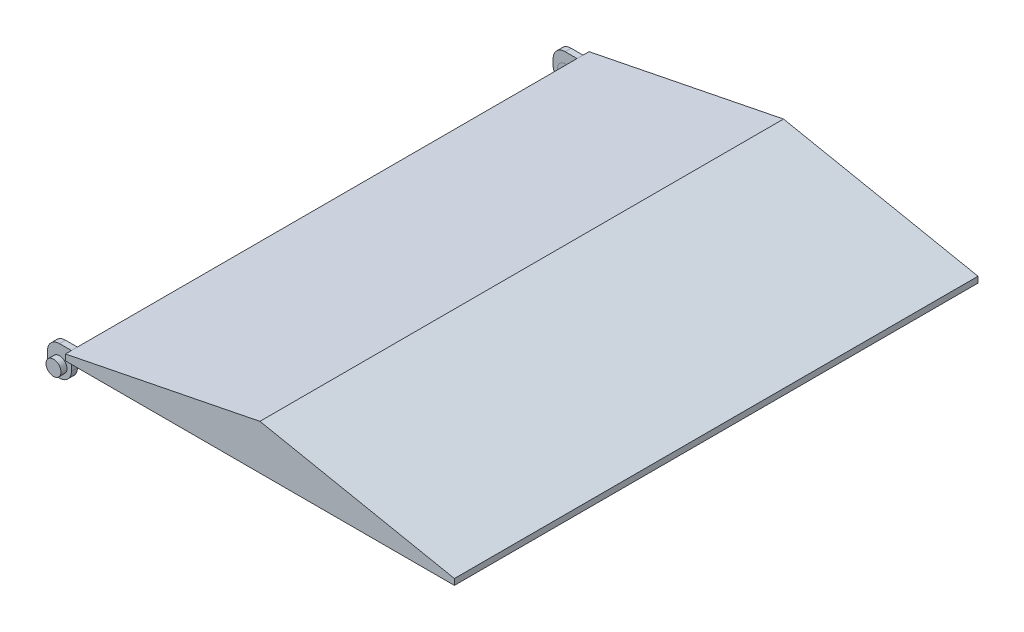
ISO-10303-21;
HEADER;
FILE_DESCRIPTION(('STEP AP214'),'2;1');
FILE_NAME('part.step','',(''),(''),'','','');
FILE_SCHEMA(('AUTOMOTIVE_DESIGN { 1 0 10303 214 1 1 1 1 }'));
ENDSEC;
DATA;
#1=APPLICATION_CONTEXT('core data for automotive mechanical design processes');
#2=APPLICATION_PROTOCOL_DEFINITION('international standard','automotive_design',2000,#1);
#3=PRODUCT_CONTEXT('',#1,'mechanical');
#4=PRODUCT('Part','Part','',(#3));
#5=PRODUCT_RELATED_PRODUCT_CATEGORY('part','',(#4));
#6=PRODUCT_DEFINITION_FORMATION('','',#4);
#7=PRODUCT_DEFINITION_CONTEXT('part definition',#1,'design');
#8=PRODUCT_DEFINITION('design','',#6,#7);
#9=PRODUCT_DEFINITION_SHAPE('','',#8);
#10=(LENGTH_UNIT() NAMED_UNIT(*) SI_UNIT(.MILLI.,.METRE.));
#11=(NAMED_UNIT(*) PLANE_ANGLE_UNIT() SI_UNIT($,.RADIAN.));
#12=(NAMED_UNIT(*) SI_UNIT($,.STERADIAN.) SOLID_ANGLE_UNIT());
#13=UNCERTAINTY_MEASURE_WITH_UNIT(LENGTH_MEASURE(1.E-05),#10,'distance_accuracy_value','');
#14=(GEOMETRIC_REPRESENTATION_CONTEXT(3) GLOBAL_UNCERTAINTY_ASSIGNED_CONTEXT((#13)) GLOBAL_UNIT_ASSIGNED_CONTEXT((#10,
#11,#12)) REPRESENTATION_CONTEXT('',''));
#15=CARTESIAN_POINT('',(0.,0.,0.));
#16=DIRECTION('',(0.,0.,1.));
#17=DIRECTION('',(1.,0.,0.));
#18=AXIS2_PLACEMENT_3D('',#15,#16,#17);
#19=CARTESIAN_POINT('',(-690.,-40.0000000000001,1750.));
#20=DIRECTION('',(0.,0.,-1.));
#21=DIRECTION('',(-1.,0.,0.));
#22=AXIS2_PLACEMENT_3D('',#19,#20,#21);
#23=CYLINDRICAL_SURFACE('',#22,25.);
#24=CARTESIAN_POINT('',(-690.,-40.0000000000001,1750.));
#25=DIRECTION('',(0.,0.,1.));
#26=DIRECTION('',(1.,0.,0.));
#27=AXIS2_PLACEMENT_3D('',#24,#25,#26);
#28=CIRCLE('',#27,25.);
#29=CARTESIAN_POINT('',(-665.,-40.0000000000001,1750.));
#30=VERTEX_POINT('',#29);
#31=EDGE_CURVE('E11',#30,#30,#28,.T.);
#32=ORIENTED_EDGE('',*,*,#31,.F.);
#33=EDGE_LOOP('',(#32));
#34=FACE_BOUND('',#33,.T.);
#35=CARTESIAN_POINT('',(-690.,-40.0000000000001,1710.));
#36=DIRECTION('',(0.,0.,1.));
#37=DIRECTION('',(1.,0.,0.));
#38=AXIS2_PLACEMENT_3D('',#35,#36,#37);
#39=CIRCLE('',#38,25.);
#40=CARTESIAN_POINT('',(-665.,-40.0000000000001,1710.));
#41=VERTEX_POINT('',#40);
#42=EDGE_CURVE('E53',#41,#41,#39,.T.);
#43=ORIENTED_EDGE('',*,*,#42,.T.);
#44=EDGE_LOOP('',(#43));
#45=FACE_BOUND('',#44,.T.);
#46=ADVANCED_FACE('F50',(#34,#45),#23,.T.);
#47=CARTESIAN_POINT('',(0.,0.,1750.));
#48=DIRECTION('',(0.,0.,1.));
#49=DIRECTION('',(1.,0.,0.));
#50=AXIS2_PLACEMENT_3D('',#47,#48,#49);
#51=PLANE('',#50);
#52=ORIENTED_EDGE('',*,*,#31,.T.);
#53=EDGE_LOOP('',(#52));
#54=FACE_BOUND('',#53,.T.);
#55=ADVANCED_FACE('F65',(#54),#51,.T.);
#56=CARTESIAN_POINT('',(0.,0.,1710.));
#57=DIRECTION('',(0.,0.,1.));
#58=DIRECTION('',(1.,0.,0.));
#59=AXIS2_PLACEMENT_3D('',#56,#57,#58);
#60=PLANE('',#59);
#61=ORIENTED_EDGE('',*,*,#42,.F.);
#62=EDGE_LOOP('',(#61));
#63=FACE_BOUND('',#62,.T.);
#64=ADVANCED_FACE('F63',(#63),#60,.F.);
#65=CLOSED_SHELL('',(#46,#55,#64));
#66=MANIFOLD_SOLID_BREP('B2',#65);
#67=CARTESIAN_POINT('',(-690.,-40.0000000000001,40.));
#68=DIRECTION('',(0.,0.,-1.));
#69=DIRECTION('',(-1.,0.,0.));
#70=AXIS2_PLACEMENT_3D('',#67,#68,#69);
#71=CYLINDRICAL_SURFACE('',#70,25.);
#72=CARTESIAN_POINT('',(-690.,-40.0000000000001,40.));
#73=DIRECTION('',(0.,0.,1.));
#74=DIRECTION('',(1.,0.,0.));
#75=AXIS2_PLACEMENT_3D('',#72,#73,#74);
#76=CIRCLE('',#75,25.);
#77=CARTESIAN_POINT('',(-665.,-40.0000000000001,40.));
#78=VERTEX_POINT('',#77);
#79=EDGE_CURVE('E49',#78,#78,#76,.T.);
#80=ORIENTED_EDGE('',*,*,#79,.F.);
#81=EDGE_LOOP('',(#80));
#82=FACE_BOUND('',#81,.T.);
#83=CARTESIAN_POINT('',(-690.,-40.0000000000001,0.));
#84=DIRECTION('',(0.,0.,1.));
#85=DIRECTION('',(1.,0.,0.));
#86=AXIS2_PLACEMENT_3D('',#83,#84,#85);
#87=CIRCLE('',#86,25.);
#88=CARTESIAN_POINT('',(-665.,-40.0000000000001,0.));
#89=VERTEX_POINT('',#88);
#90=EDGE_CURVE('E109',#89,#89,#87,.T.);
#91=ORIENTED_EDGE('',*,*,#90,.T.);
#92=EDGE_LOOP('',(#91));
#93=FACE_BOUND('',#92,.T.);
#94=ADVANCED_FACE('F106',(#82,#93),#71,.T.);
#95=CARTESIAN_POINT('',(0.,0.,40.));
#96=DIRECTION('',(0.,0.,1.));
#97=DIRECTION('',(1.,0.,0.));
#98=AXIS2_PLACEMENT_3D('',#95,#96,#97);
#99=PLANE('',#98);
#100=ORIENTED_EDGE('',*,*,#79,.T.);
#101=EDGE_LOOP('',(#100));
#102=FACE_BOUND('',#101,.T.);
#103=ADVANCED_FACE('F121',(#102),#99,.T.);
#104=CARTESIAN_POINT('',(0.,0.,0.));
#105=DIRECTION('',(0.,0.,1.));
#106=DIRECTION('',(1.,0.,0.));
#107=AXIS2_PLACEMENT_3D('',#104,#105,#106);
#108=PLANE('',#107);
#109=ORIENTED_EDGE('',*,*,#90,.F.);
#110=EDGE_LOOP('',(#109));
#111=FACE_BOUND('',#110,.T.);
#112=ADVANCED_FACE('F119',(#111),#108,.F.);
#113=CLOSED_SHELL('',(#94,#103,#112));
#114=MANIFOLD_SOLID_BREP('B6',#113);
#115=CARTESIAN_POINT('',(-650.,0.,1750.));
#116=DIRECTION('',(1.,0.,0.));
#117=DIRECTION('',(0.,0.,-1.));
#118=AXIS2_PLACEMENT_3D('',#115,#116,#117);
#119=PLANE('',#118);
#120=DIRECTION('',(0.,-1.,0.));
#121=VECTOR('',#120,1.);
#122=CARTESIAN_POINT('',(-650.,0.,1710.));
#123=LINE('',#122,#121);
#124=CARTESIAN_POINT('',(-650.,19.9999999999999,1710.));
#125=VERTEX_POINT('',#124);
#126=CARTESIAN_POINT('',(-650.,0.,1710.));
#127=VERTEX_POINT('',#126);
#128=EDGE_CURVE('E453',#125,#127,#123,.T.);
#129=ORIENTED_EDGE('',*,*,#128,.F.);
#130=DIRECTION('',(0.,0.,-1.));
#131=VECTOR('',#130,1.);
#132=CARTESIAN_POINT('',(-650.,19.9999999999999,1750.));
#133=LINE('',#132,#131);
#134=CARTESIAN_POINT('',(-650.,19.9999999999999,40.));
#135=VERTEX_POINT('',#134);
#136=EDGE_CURVE('E346',#125,#135,#133,.T.);
#137=ORIENTED_EDGE('',*,*,#136,.T.);
#138=DIRECTION('',(0.,-1.,0.));
#139=VECTOR('',#138,1.);
#140=CARTESIAN_POINT('',(-650.,0.,40.));
#141=LINE('',#140,#139);
#142=CARTESIAN_POINT('',(-650.,0.,40.));
#143=VERTEX_POINT('',#142);
#144=EDGE_CURVE('E462',#135,#143,#141,.T.);
#145=ORIENTED_EDGE('',*,*,#144,.T.);
#146=DIRECTION('',(0.,0.,-1.));
#147=VECTOR('',#146,1.);
#148=CARTESIAN_POINT('',(-650.,0.,1750.));
#149=LINE('',#148,#147);
#150=EDGE_CURVE('E367',#127,#143,#149,.T.);
#151=ORIENTED_EDGE('',*,*,#150,.F.);
#152=EDGE_LOOP('',(#129,#137,#145,#151));
#153=FACE_BOUND('',#152,.T.);
#154=ADVANCED_FACE('F154',(#153),#119,.F.);
#155=DIRECTION('',(0.,-1.,0.));
#156=VECTOR('',#155,1.);
#157=CARTESIAN_POINT('',(-650.,0.,20.));
#158=LINE('',#157,#156);
#159=CARTESIAN_POINT('',(-650.,19.9999999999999,20.));
#160=VERTEX_POINT('',#159);
#161=CARTESIAN_POINT('',(-650.,0.,20.));
#162=VERTEX_POINT('',#161);
#163=EDGE_CURVE('E474',#160,#162,#158,.T.);
#164=ORIENTED_EDGE('',*,*,#163,.F.);
#165=CARTESIAN_POINT('',(-650.,19.9999999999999,0.));
#166=VERTEX_POINT('',#165);
#167=EDGE_CURVE('E354',#160,#166,#133,.T.);
#168=ORIENTED_EDGE('',*,*,#167,.T.);
#169=DIRECTION('',(0.,-1.,0.));
#170=VECTOR('',#169,1.);
#171=CARTESIAN_POINT('',(-650.,0.,0.));
#172=LINE('',#171,#170);
#173=CARTESIAN_POINT('',(-650.,0.,0.));
#174=VERTEX_POINT('',#173);
#175=EDGE_CURVE('E525',#166,#174,#172,.T.);
#176=ORIENTED_EDGE('',*,*,#175,.T.);
#177=EDGE_CURVE('E372',#162,#174,#149,.T.);
#178=ORIENTED_EDGE('',*,*,#177,.F.);
#179=EDGE_LOOP('',(#164,#168,#176,#178));
#180=FACE_BOUND('',#179,.T.);
#181=ADVANCED_FACE('F542',(#180),#119,.F.);
#182=CARTESIAN_POINT('',(-28.8461538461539,144.230769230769,1750.));
#183=DIRECTION('',(-0.196116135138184,0.98058067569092,0.));
#184=DIRECTION('',(-0.98058067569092,-0.196116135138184,0.));
#185=AXIS2_PLACEMENT_3D('',#182,#183,#184);
#186=PLANE('',#185);
#187=DIRECTION('',(0.98058067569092,0.196116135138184,0.));
#188=VECTOR('',#187,1.);
#189=CARTESIAN_POINT('',(-28.8461538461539,144.230769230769,0.));
#190=LINE('',#189,#188);
#191=CARTESIAN_POINT('',(0.,150.,0.));
#192=VERTEX_POINT('',#191);
#193=EDGE_CURVE('E514',#166,#192,#190,.T.);
#194=ORIENTED_EDGE('',*,*,#193,.F.);
#195=ORIENTED_EDGE('',*,*,#167,.F.);
#196=DIRECTION('',(0.,0.,-1.));
#197=VECTOR('',#196,1.);
#198=CARTESIAN_POINT('',(-650.,19.9999999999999,40.));
#199=LINE('',#198,#197);
#200=EDGE_CURVE('E470',#135,#160,#199,.T.);
#201=ORIENTED_EDGE('',*,*,#200,.F.);
#202=ORIENTED_EDGE('',*,*,#136,.F.);
#203=DIRECTION('',(0.,0.,-1.));
#204=VECTOR('',#203,1.);
#205=CARTESIAN_POINT('',(-650.,19.9999999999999,1730.));
#206=LINE('',#205,#204);
#207=CARTESIAN_POINT('',(-650.,19.9999999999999,1730.));
#208=VERTEX_POINT('',#207);
#209=EDGE_CURVE('E321',#208,#125,#206,.T.);
#210=ORIENTED_EDGE('',*,*,#209,.F.);
#211=CARTESIAN_POINT('',(-650.,19.9999999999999,1750.));
#212=VERTEX_POINT('',#211);
#213=EDGE_CURVE('E342',#212,#208,#133,.T.);
#214=ORIENTED_EDGE('',*,*,#213,.F.);
#215=DIRECTION('',(0.98058067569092,0.196116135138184,0.));
#216=VECTOR('',#215,1.);
#217=CARTESIAN_POINT('',(-28.8461538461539,144.230769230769,1750.));
#218=LINE('',#217,#216);
#219=CARTESIAN_POINT('',(0.,150.,1750.));
#220=VERTEX_POINT('',#219);
#221=EDGE_CURVE('E522',#212,#220,#218,.T.);
#222=ORIENTED_EDGE('',*,*,#221,.T.);
#223=DIRECTION('',(0.,0.,-1.));
#224=VECTOR('',#223,1.);
#225=CARTESIAN_POINT('',(0.,150.,1750.));
#226=LINE('',#225,#224);
#227=EDGE_CURVE('E383',#220,#192,#226,.T.);
#228=ORIENTED_EDGE('',*,*,#227,.T.);
#229=EDGE_LOOP('',(#194,#195,#201,#202,#210,#214,#222,#228));
#230=FACE_BOUND('',#229,.T.);
#231=ADVANCED_FACE('F340',(#230),#186,.T.);
#232=ORIENTED_EDGE('',*,*,#213,.T.);
#233=DIRECTION('',(0.,-1.,0.));
#234=VECTOR('',#233,1.);
#235=CARTESIAN_POINT('',(-650.,0.,1730.));
#236=LINE('',#235,#234);
#237=CARTESIAN_POINT('',(-650.,0.,1730.));
#238=VERTEX_POINT('',#237);
#239=EDGE_CURVE('E325',#208,#238,#236,.T.);
#240=ORIENTED_EDGE('',*,*,#239,.T.);
#241=CARTESIAN_POINT('',(-650.,0.,1750.));
#242=VERTEX_POINT('',#241);
#243=EDGE_CURVE('E360',#242,#238,#149,.T.);
#244=ORIENTED_EDGE('',*,*,#243,.F.);
#245=DIRECTION('',(0.,-1.,0.));
#246=VECTOR('',#245,1.);
#247=CARTESIAN_POINT('',(-650.,0.,1750.));
#248=LINE('',#247,#246);
#249=EDGE_CURVE('E350',#212,#242,#248,.T.);
#250=ORIENTED_EDGE('',*,*,#249,.F.);
#251=EDGE_LOOP('',(#232,#240,#244,#250));
#252=FACE_BOUND('',#251,.T.);
#253=ADVANCED_FACE('F349',(#252),#119,.F.);
#254=CARTESIAN_POINT('',(0.,0.,1750.));
#255=DIRECTION('',(0.,-1.,0.));
#256=DIRECTION('',(1.,0.,0.));
#257=AXIS2_PLACEMENT_3D('',#254,#255,#256);
#258=PLANE('',#257);
#259=DIRECTION('',(-1.,0.,0.));
#260=VECTOR('',#259,1.);
#261=CARTESIAN_POINT('',(0.,0.,0.));
#262=LINE('',#261,#260);
#263=CARTESIAN_POINT('',(650.,0.,0.));
#264=VERTEX_POINT('',#263);
#265=EDGE_CURVE('E540',#264,#174,#262,.T.);
#266=ORIENTED_EDGE('',*,*,#265,.F.);
#267=DIRECTION('',(0.,0.,-1.));
#268=VECTOR('',#267,1.);
#269=CARTESIAN_POINT('',(650.,0.,1750.));
#270=LINE('',#269,#268);
#271=CARTESIAN_POINT('',(650.,0.,1750.));
#272=VERTEX_POINT('',#271);
#273=EDGE_CURVE('E376',#272,#264,#270,.T.);
#274=ORIENTED_EDGE('',*,*,#273,.F.);
#275=DIRECTION('',(-1.,0.,0.));
#276=VECTOR('',#275,1.);
#277=CARTESIAN_POINT('',(0.,0.,1750.));
#278=LINE('',#277,#276);
#279=EDGE_CURVE('E529',#272,#242,#278,.T.);
#280=ORIENTED_EDGE('',*,*,#279,.T.);
#281=ORIENTED_EDGE('',*,*,#243,.T.);
#282=EDGE_CURVE('E366',#238,#127,#149,.T.);
#283=ORIENTED_EDGE('',*,*,#282,.T.);
#284=ORIENTED_EDGE('',*,*,#150,.T.);
#285=EDGE_CURVE('E368',#143,#162,#149,.T.);
#286=ORIENTED_EDGE('',*,*,#285,.T.);
#287=ORIENTED_EDGE('',*,*,#177,.T.);
#288=EDGE_LOOP('',(#266,#274,#280,#281,#283,#284,#286,#287));
#289=FACE_BOUND('',#288,.T.);
#290=ADVANCED_FACE('F546',(#289),#258,.T.);
#291=CARTESIAN_POINT('',(650.,0.,1750.));
#292=DIRECTION('',(1.,0.,0.));
#293=DIRECTION('',(0.,0.,-1.));
#294=AXIS2_PLACEMENT_3D('',#291,#292,#293);
#295=PLANE('',#294);
#296=DIRECTION('',(0.,-1.,0.));
#297=VECTOR('',#296,1.);
#298=CARTESIAN_POINT('',(650.,0.,0.));
#299=LINE('',#298,#297);
#300=CARTESIAN_POINT('',(650.,20.,0.));
#301=VERTEX_POINT('',#300);
#302=EDGE_CURVE('E537',#301,#264,#299,.T.);
#303=ORIENTED_EDGE('',*,*,#302,.F.);
#304=DIRECTION('',(0.,0.,-1.));
#305=VECTOR('',#304,1.);
#306=CARTESIAN_POINT('',(650.,20.,1750.));
#307=LINE('',#306,#305);
#308=CARTESIAN_POINT('',(650.,20.,1750.));
#309=VERTEX_POINT('',#308);
#310=EDGE_CURVE('E379',#309,#301,#307,.T.);
#311=ORIENTED_EDGE('',*,*,#310,.F.);
#312=DIRECTION('',(0.,-1.,0.));
#313=VECTOR('',#312,1.);
#314=CARTESIAN_POINT('',(650.,0.,1750.));
#315=LINE('',#314,#313);
#316=EDGE_CURVE('E527',#309,#272,#315,.T.);
#317=ORIENTED_EDGE('',*,*,#316,.T.);
#318=ORIENTED_EDGE('',*,*,#273,.T.);
#319=EDGE_LOOP('',(#303,#311,#317,#318));
#320=FACE_BOUND('',#319,.T.);
#321=ADVANCED_FACE('F551',(#320),#295,.T.);
#322=CARTESIAN_POINT('',(28.8461538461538,144.230769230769,1750.));
#323=DIRECTION('',(-0.196116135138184,-0.98058067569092,0.));
#324=DIRECTION('',(0.98058067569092,-0.196116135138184,0.));
#325=AXIS2_PLACEMENT_3D('',#322,#323,#324);
#326=PLANE('',#325);
#327=DIRECTION('',(-0.98058067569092,0.196116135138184,0.));
#328=VECTOR('',#327,1.);
#329=CARTESIAN_POINT('',(28.8461538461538,144.230769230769,0.));
#330=LINE('',#329,#328);
#331=EDGE_CURVE('E534',#301,#192,#330,.T.);
#332=ORIENTED_EDGE('',*,*,#331,.T.);
#333=ORIENTED_EDGE('',*,*,#227,.F.);
#334=DIRECTION('',(-0.98058067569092,0.196116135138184,0.));
#335=VECTOR('',#334,1.);
#336=CARTESIAN_POINT('',(28.8461538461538,144.230769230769,1750.));
#337=LINE('',#336,#335);
#338=EDGE_CURVE('E524',#309,#220,#337,.T.);
#339=ORIENTED_EDGE('',*,*,#338,.F.);
#340=ORIENTED_EDGE('',*,*,#310,.T.);
#341=EDGE_LOOP('',(#332,#333,#339,#340));
#342=FACE_BOUND('',#341,.T.);
#343=ADVANCED_FACE('F555',(#342),#326,.F.);
#344=CARTESIAN_POINT('',(0.,0.,1750.));
#345=DIRECTION('',(0.,0.,-1.));
#346=DIRECTION('',(-1.,0.,0.));
#347=AXIS2_PLACEMENT_3D('',#344,#345,#346);
#348=PLANE('',#347);
#349=ORIENTED_EDGE('',*,*,#221,.F.);
#350=ORIENTED_EDGE('',*,*,#249,.T.);
#351=ORIENTED_EDGE('',*,*,#279,.F.);
#352=ORIENTED_EDGE('',*,*,#316,.F.);
#353=ORIENTED_EDGE('',*,*,#338,.T.);
#354=EDGE_LOOP('',(#349,#350,#351,#352,#353));
#355=FACE_BOUND('',#354,.T.);
#356=ADVANCED_FACE('F550',(#355),#348,.F.);
#357=CARTESIAN_POINT('',(0.,0.,0.));
#358=DIRECTION('',(0.,0.,-1.));
#359=DIRECTION('',(-1.,0.,0.));
#360=AXIS2_PLACEMENT_3D('',#357,#358,#359);
#361=PLANE('',#360);
#362=ORIENTED_EDGE('',*,*,#193,.T.);
#363=ORIENTED_EDGE('',*,*,#331,.F.);
#364=ORIENTED_EDGE('',*,*,#302,.T.);
#365=ORIENTED_EDGE('',*,*,#265,.T.);
#366=ORIENTED_EDGE('',*,*,#175,.F.);
#367=EDGE_LOOP('',(#362,#363,#364,#365,#366));
#368=FACE_BOUND('',#367,.T.);
#369=ADVANCED_FACE('F544',(#368),#361,.T.);
#370=CARTESIAN_POINT('',(-650.,0.,40.));
#371=DIRECTION('',(1.,0.,0.));
#372=DIRECTION('',(0.,0.,-1.));
#373=AXIS2_PLACEMENT_3D('',#370,#371,#372);
#374=PLANE('',#373);
#375=CARTESIAN_POINT('',(-650.,-40.0000000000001,40.));
#376=VERTEX_POINT('',#375);
#377=EDGE_CURVE('E460',#143,#376,#141,.T.);
#378=ORIENTED_EDGE('',*,*,#377,.T.);
#379=DIRECTION('',(0.,0.,-1.));
#380=VECTOR('',#379,1.);
#381=CARTESIAN_POINT('',(-650.,-40.0000000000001,40.));
#382=LINE('',#381,#380);
#383=CARTESIAN_POINT('',(-650.,-40.0000000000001,20.));
#384=VERTEX_POINT('',#383);
#385=EDGE_CURVE('E352',#376,#384,#382,.T.);
#386=ORIENTED_EDGE('',*,*,#385,.T.);
#387=EDGE_CURVE('E473',#162,#384,#158,.T.);
#388=ORIENTED_EDGE('',*,*,#387,.F.);
#389=ORIENTED_EDGE('',*,*,#285,.F.);
#390=EDGE_LOOP('',(#378,#386,#388,#389));
#391=FACE_BOUND('',#390,.T.);
#392=ADVANCED_FACE('F585',(#391),#374,.T.);
#393=CARTESIAN_POINT('',(0.,19.9999999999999,40.));
#394=DIRECTION('',(0.,1.,0.));
#395=DIRECTION('',(0.,0.,1.));
#396=AXIS2_PLACEMENT_3D('',#393,#394,#395);
#397=PLANE('',#396);
#398=DIRECTION('',(1.,0.,0.));
#399=VECTOR('',#398,1.);
#400=CARTESIAN_POINT('',(0.,19.9999999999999,20.));
#401=LINE('',#400,#399);
#402=CARTESIAN_POINT('',(-690.,19.9999999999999,20.));
#403=VERTEX_POINT('',#402);
#404=EDGE_CURVE('E477',#403,#160,#401,.T.);
#405=ORIENTED_EDGE('',*,*,#404,.F.);
#406=DIRECTION('',(0.,0.,-1.));
#407=VECTOR('',#406,1.);
#408=CARTESIAN_POINT('',(-690.,19.9999999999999,40.));
#409=LINE('',#408,#407);
#410=CARTESIAN_POINT('',(-690.,19.9999999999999,40.));
#411=VERTEX_POINT('',#410);
#412=EDGE_CURVE('E403',#403,#411,#409,.F.);
#413=ORIENTED_EDGE('',*,*,#412,.T.);
#414=DIRECTION('',(1.,0.,0.));
#415=VECTOR('',#414,1.);
#416=CARTESIAN_POINT('',(0.,19.9999999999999,40.));
#417=LINE('',#416,#415);
#418=EDGE_CURVE('E465',#411,#135,#417,.T.);
#419=ORIENTED_EDGE('',*,*,#418,.T.);
#420=ORIENTED_EDGE('',*,*,#200,.T.);
#421=EDGE_LOOP('',(#405,#413,#419,#420));
#422=FACE_BOUND('',#421,.T.);
#423=ADVANCED_FACE('F558',(#422),#397,.T.);
#424=CARTESIAN_POINT('',(-730.,0.,40.));
#425=DIRECTION('',(-1.,0.,0.));
#426=DIRECTION('',(0.,0.,1.));
#427=AXIS2_PLACEMENT_3D('',#424,#425,#426);
#428=PLANE('',#427);
#429=DIRECTION('',(0.,1.,0.));
#430=VECTOR('',#429,1.);
#431=CARTESIAN_POINT('',(-730.,0.,20.));
#432=LINE('',#431,#430);
#433=CARTESIAN_POINT('',(-730.,-40.0000000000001,20.));
#434=VERTEX_POINT('',#433);
#435=CARTESIAN_POINT('',(-730.,-20.0000000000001,20.));
#436=VERTEX_POINT('',#435);
#437=EDGE_CURVE('E461',#434,#436,#432,.T.);
#438=ORIENTED_EDGE('',*,*,#437,.F.);
#439=DIRECTION('',(0.,0.,-1.));
#440=VECTOR('',#439,1.);
#441=CARTESIAN_POINT('',(-730.,-40.0000000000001,40.));
#442=LINE('',#441,#440);
#443=CARTESIAN_POINT('',(-730.,-40.0000000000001,40.));
#444=VERTEX_POINT('',#443);
#445=EDGE_CURVE('E401',#434,#444,#442,.F.);
#446=ORIENTED_EDGE('',*,*,#445,.T.);
#447=DIRECTION('',(0.,1.,0.));
#448=VECTOR('',#447,1.);
#449=CARTESIAN_POINT('',(-730.,0.,40.));
#450=LINE('',#449,#448);
#451=CARTESIAN_POINT('',(-730.,-20.0000000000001,40.));
#452=VERTEX_POINT('',#451);
#453=EDGE_CURVE('E467',#444,#452,#450,.T.);
#454=ORIENTED_EDGE('',*,*,#453,.T.);
#455=DIRECTION('',(0.,0.,-1.));
#456=VECTOR('',#455,1.);
#457=CARTESIAN_POINT('',(-730.,-20.0000000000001,40.));
#458=LINE('',#457,#456);
#459=EDGE_CURVE('E398',#452,#436,#458,.T.);
#460=ORIENTED_EDGE('',*,*,#459,.T.);
#461=EDGE_LOOP('',(#438,#446,#454,#460));
#462=FACE_BOUND('',#461,.T.);
#463=ADVANCED_FACE('F570',(#462),#428,.T.);
#464=CARTESIAN_POINT('',(-690.,-40.0000000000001,40.));
#465=DIRECTION('',(0.,0.,-1.));
#466=DIRECTION('',(-1.,0.,0.));
#467=AXIS2_PLACEMENT_3D('',#464,#465,#466);
#468=CYLINDRICAL_SURFACE('',#467,25.);
#469=CARTESIAN_POINT('',(-690.,-40.0000000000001,40.));
#470=DIRECTION('',(0.,0.,1.));
#471=DIRECTION('',(1.,0.,0.));
#472=AXIS2_PLACEMENT_3D('',#469,#470,#471);
#473=CIRCLE('',#472,25.);
#474=CARTESIAN_POINT('',(-665.,-40.0000000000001,40.));
#475=VERTEX_POINT('',#474);
#476=EDGE_CURVE('E457',#475,#475,#473,.T.);
#477=ORIENTED_EDGE('',*,*,#476,.T.);
#478=EDGE_LOOP('',(#477));
#479=FACE_BOUND('',#478,.T.);
#480=CARTESIAN_POINT('',(-690.,-40.0000000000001,20.));
#481=DIRECTION('',(0.,0.,1.));
#482=DIRECTION('',(1.,0.,0.));
#483=AXIS2_PLACEMENT_3D('',#480,#481,#482);
#484=CIRCLE('',#483,25.);
#485=CARTESIAN_POINT('',(-665.,-40.0000000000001,20.));
#486=VERTEX_POINT('',#485);
#487=EDGE_CURVE('E347',#486,#486,#484,.T.);
#488=ORIENTED_EDGE('',*,*,#487,.F.);
#489=EDGE_LOOP('',(#488));
#490=FACE_BOUND('',#489,.T.);
#491=ADVANCED_FACE('F737',(#479,#490),#468,.F.);
#492=CARTESIAN_POINT('',(0.,0.,40.));
#493=DIRECTION('',(0.,0.,1.));
#494=DIRECTION('',(1.,0.,0.));
#495=AXIS2_PLACEMENT_3D('',#492,#493,#494);
#496=PLANE('',#495);
#497=ORIENTED_EDGE('',*,*,#476,.F.);
#498=EDGE_LOOP('',(#497));
#499=FACE_BOUND('',#498,.T.);
#500=CARTESIAN_POINT('',(-690.,-40.0000000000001,40.));
#501=DIRECTION('',(0.,0.,1.));
#502=DIRECTION('',(1.,0.,0.));
#503=AXIS2_PLACEMENT_3D('',#500,#501,#502);
#504=CIRCLE('',#503,40.);
#505=CARTESIAN_POINT('',(-690.,-80.0000000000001,40.));
#506=VERTEX_POINT('',#505);
#507=EDGE_CURVE('E394',#444,#506,#504,.T.);
#508=ORIENTED_EDGE('',*,*,#507,.T.);
#509=CARTESIAN_POINT('',(-690.,-40.0000000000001,40.));
#510=DIRECTION('',(0.,0.,1.));
#511=DIRECTION('',(1.,0.,0.));
#512=AXIS2_PLACEMENT_3D('',#509,#510,#511);
#513=CIRCLE('',#512,40.);
#514=EDGE_CURVE('E396',#506,#376,#513,.T.);
#515=ORIENTED_EDGE('',*,*,#514,.T.);
#516=ORIENTED_EDGE('',*,*,#377,.F.);
#517=ORIENTED_EDGE('',*,*,#144,.F.);
#518=ORIENTED_EDGE('',*,*,#418,.F.);
#519=CARTESIAN_POINT('',(-690.,-20.0000000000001,40.));
#520=DIRECTION('',(0.,0.,1.));
#521=DIRECTION('',(1.,0.,0.));
#522=AXIS2_PLACEMENT_3D('',#519,#520,#521);
#523=CIRCLE('',#522,40.);
#524=EDGE_CURVE('E392',#411,#452,#523,.T.);
#525=ORIENTED_EDGE('',*,*,#524,.T.);
#526=ORIENTED_EDGE('',*,*,#453,.F.);
#527=EDGE_LOOP('',(#508,#515,#516,#517,#518,#525,#526));
#528=FACE_BOUND('',#527,.T.);
#529=ADVANCED_FACE('F575',(#499,#528),#496,.T.);
#530=CARTESIAN_POINT('',(0.,0.,20.));
#531=DIRECTION('',(0.,0.,1.));
#532=DIRECTION('',(1.,0.,0.));
#533=AXIS2_PLACEMENT_3D('',#530,#531,#532);
#534=PLANE('',#533);
#535=ORIENTED_EDGE('',*,*,#487,.T.);
#536=EDGE_LOOP('',(#535));
#537=FACE_BOUND('',#536,.T.);
#538=ORIENTED_EDGE('',*,*,#387,.T.);
#539=CARTESIAN_POINT('',(-690.,-40.0000000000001,20.));
#540=DIRECTION('',(0.,0.,1.));
#541=DIRECTION('',(1.,0.,0.));
#542=AXIS2_PLACEMENT_3D('',#539,#540,#541);
#543=CIRCLE('',#542,40.);
#544=CARTESIAN_POINT('',(-690.,-80.0000000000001,20.));
#545=VERTEX_POINT('',#544);
#546=EDGE_CURVE('E390',#384,#545,#543,.F.);
#547=ORIENTED_EDGE('',*,*,#546,.T.);
#548=CARTESIAN_POINT('',(-690.,-40.0000000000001,20.));
#549=DIRECTION('',(0.,0.,1.));
#550=DIRECTION('',(1.,0.,0.));
#551=AXIS2_PLACEMENT_3D('',#548,#549,#550);
#552=CIRCLE('',#551,40.);
#553=EDGE_CURVE('E388',#545,#434,#552,.F.);
#554=ORIENTED_EDGE('',*,*,#553,.T.);
#555=ORIENTED_EDGE('',*,*,#437,.T.);
#556=CARTESIAN_POINT('',(-690.,-20.0000000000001,20.));
#557=DIRECTION('',(0.,0.,1.));
#558=DIRECTION('',(1.,0.,0.));
#559=AXIS2_PLACEMENT_3D('',#556,#557,#558);
#560=CIRCLE('',#559,40.);
#561=EDGE_CURVE('E356',#436,#403,#560,.F.);
#562=ORIENTED_EDGE('',*,*,#561,.T.);
#563=ORIENTED_EDGE('',*,*,#404,.T.);
#564=ORIENTED_EDGE('',*,*,#163,.T.);
#565=EDGE_LOOP('',(#538,#547,#554,#555,#562,#563,#564));
#566=FACE_BOUND('',#565,.T.);
#567=ADVANCED_FACE('F563',(#537,#566),#534,.F.);
#568=CARTESIAN_POINT('',(-650.,0.,1730.));
#569=DIRECTION('',(1.,0.,0.));
#570=DIRECTION('',(0.,0.,-1.));
#571=AXIS2_PLACEMENT_3D('',#568,#569,#570);
#572=PLANE('',#571);
#573=CARTESIAN_POINT('',(-650.,-40.0000000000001,1730.));
#574=VERTEX_POINT('',#573);
#575=EDGE_CURVE('E331',#238,#574,#236,.T.);
#576=ORIENTED_EDGE('',*,*,#575,.T.);
#577=DIRECTION('',(0.,0.,-1.));
#578=VECTOR('',#577,1.);
#579=CARTESIAN_POINT('',(-650.,-40.0000000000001,1730.));
#580=LINE('',#579,#578);
#581=CARTESIAN_POINT('',(-650.,-40.0000000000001,1710.));
#582=VERTEX_POINT('',#581);
#583=EDGE_CURVE('E405',#574,#582,#580,.T.);
#584=ORIENTED_EDGE('',*,*,#583,.T.);
#585=EDGE_CURVE('E428',#127,#582,#123,.T.);
#586=ORIENTED_EDGE('',*,*,#585,.F.);
#587=ORIENTED_EDGE('',*,*,#282,.F.);
#588=EDGE_LOOP('',(#576,#584,#586,#587));
#589=FACE_BOUND('',#588,.T.);
#590=ADVANCED_FACE('F703',(#589),#572,.T.);
#591=CARTESIAN_POINT('',(0.,19.9999999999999,1730.));
#592=DIRECTION('',(0.,1.,0.));
#593=DIRECTION('',(0.,0.,1.));
#594=AXIS2_PLACEMENT_3D('',#591,#592,#593);
#595=PLANE('',#594);
#596=DIRECTION('',(1.,0.,0.));
#597=VECTOR('',#596,1.);
#598=CARTESIAN_POINT('',(0.,19.9999999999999,1710.));
#599=LINE('',#598,#597);
#600=CARTESIAN_POINT('',(-690.,19.9999999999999,1710.));
#601=VERTEX_POINT('',#600);
#602=EDGE_CURVE('E449',#601,#125,#599,.T.);
#603=ORIENTED_EDGE('',*,*,#602,.F.);
#604=DIRECTION('',(0.,0.,-1.));
#605=VECTOR('',#604,1.);
#606=CARTESIAN_POINT('',(-690.,19.9999999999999,1730.));
#607=LINE('',#606,#605);
#608=CARTESIAN_POINT('',(-690.,19.9999999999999,1730.));
#609=VERTEX_POINT('',#608);
#610=EDGE_CURVE('E104',#601,#609,#607,.F.);
#611=ORIENTED_EDGE('',*,*,#610,.T.);
#612=DIRECTION('',(1.,0.,0.));
#613=VECTOR('',#612,1.);
#614=CARTESIAN_POINT('',(0.,19.9999999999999,1730.));
#615=LINE('',#614,#613);
#616=EDGE_CURVE('E316',#609,#208,#615,.T.);
#617=ORIENTED_EDGE('',*,*,#616,.T.);
#618=ORIENTED_EDGE('',*,*,#209,.T.);
#619=EDGE_LOOP('',(#603,#611,#617,#618));
#620=FACE_BOUND('',#619,.T.);
#621=ADVANCED_FACE('F319',(#620),#595,.T.);
#622=CARTESIAN_POINT('',(-730.,0.,1730.));
#623=DIRECTION('',(-1.,0.,0.));
#624=DIRECTION('',(0.,0.,1.));
#625=AXIS2_PLACEMENT_3D('',#622,#623,#624);
#626=PLANE('',#625);
#627=DIRECTION('',(0.,1.,0.));
#628=VECTOR('',#627,1.);
#629=CARTESIAN_POINT('',(-730.,0.,1710.));
#630=LINE('',#629,#628);
#631=CARTESIAN_POINT('',(-730.,-40.0000000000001,1710.));
#632=VERTEX_POINT('',#631);
#633=CARTESIAN_POINT('',(-730.,-20.0000000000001,1710.));
#634=VERTEX_POINT('',#633);
#635=EDGE_CURVE('E444',#632,#634,#630,.T.);
#636=ORIENTED_EDGE('',*,*,#635,.F.);
#637=DIRECTION('',(0.,0.,-1.));
#638=VECTOR('',#637,1.);
#639=CARTESIAN_POINT('',(-730.,-40.0000000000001,1730.));
#640=LINE('',#639,#638);
#641=CARTESIAN_POINT('',(-730.,-40.0000000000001,1730.));
#642=VERTEX_POINT('',#641);
#643=EDGE_CURVE('E163',#632,#642,#640,.F.);
#644=ORIENTED_EDGE('',*,*,#643,.T.);
#645=DIRECTION('',(0.,1.,0.));
#646=VECTOR('',#645,1.);
#647=CARTESIAN_POINT('',(-730.,0.,1730.));
#648=LINE('',#647,#646);
#649=CARTESIAN_POINT('',(-730.,-20.0000000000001,1730.));
#650=VERTEX_POINT('',#649);
#651=EDGE_CURVE('E324',#642,#650,#648,.T.);
#652=ORIENTED_EDGE('',*,*,#651,.T.);
#653=DIRECTION('',(0.,0.,-1.));
#654=VECTOR('',#653,1.);
#655=CARTESIAN_POINT('',(-730.,-20.0000000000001,1730.));
#656=LINE('',#655,#654);
#657=EDGE_CURVE('E418',#650,#634,#656,.T.);
#658=ORIENTED_EDGE('',*,*,#657,.T.);
#659=EDGE_LOOP('',(#636,#644,#652,#658));
#660=FACE_BOUND('',#659,.T.);
#661=ADVANCED_FACE('F446',(#660),#626,.T.);
#662=CARTESIAN_POINT('',(-690.,-40.0000000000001,1730.));
#663=DIRECTION('',(0.,0.,-1.));
#664=DIRECTION('',(-1.,0.,0.));
#665=AXIS2_PLACEMENT_3D('',#662,#663,#664);
#666=CYLINDRICAL_SURFACE('',#665,25.);
#667=CARTESIAN_POINT('',(-690.,-40.0000000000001,1730.));
#668=DIRECTION('',(0.,0.,1.));
#669=DIRECTION('',(1.,0.,0.));
#670=AXIS2_PLACEMENT_3D('',#667,#668,#669);
#671=CIRCLE('',#670,25.);
#672=CARTESIAN_POINT('',(-665.,-40.0000000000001,1730.));
#673=VERTEX_POINT('',#672);
#674=EDGE_CURVE('E448',#673,#673,#671,.T.);
#675=ORIENTED_EDGE('',*,*,#674,.T.);
#676=EDGE_LOOP('',(#675));
#677=FACE_BOUND('',#676,.T.);
#678=CARTESIAN_POINT('',(-690.,-40.0000000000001,1710.));
#679=DIRECTION('',(0.,0.,1.));
#680=DIRECTION('',(1.,0.,0.));
#681=AXIS2_PLACEMENT_3D('',#678,#679,#680);
#682=CIRCLE('',#681,25.);
#683=CARTESIAN_POINT('',(-665.,-40.0000000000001,1710.));
#684=VERTEX_POINT('',#683);
#685=EDGE_CURVE('E423',#684,#684,#682,.T.);
#686=ORIENTED_EDGE('',*,*,#685,.F.);
#687=EDGE_LOOP('',(#686));
#688=FACE_BOUND('',#687,.T.);
#689=ADVANCED_FACE('F676',(#677,#688),#666,.F.);
#690=CARTESIAN_POINT('',(0.,0.,1730.));
#691=DIRECTION('',(0.,0.,1.));
#692=DIRECTION('',(1.,0.,0.));
#693=AXIS2_PLACEMENT_3D('',#690,#691,#692);
#694=PLANE('',#693);
#695=ORIENTED_EDGE('',*,*,#674,.F.);
#696=EDGE_LOOP('',(#695));
#697=FACE_BOUND('',#696,.T.);
#698=CARTESIAN_POINT('',(-690.,-40.0000000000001,1730.));
#699=DIRECTION('',(0.,0.,1.));
#700=DIRECTION('',(1.,0.,0.));
#701=AXIS2_PLACEMENT_3D('',#698,#699,#700);
#702=CIRCLE('',#701,40.);
#703=CARTESIAN_POINT('',(-690.,-80.0000000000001,1730.));
#704=VERTEX_POINT('',#703);
#705=EDGE_CURVE('E171',#642,#704,#702,.T.);
#706=ORIENTED_EDGE('',*,*,#705,.T.);
#707=CARTESIAN_POINT('',(-690.,-40.0000000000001,1730.));
#708=DIRECTION('',(0.,0.,1.));
#709=DIRECTION('',(1.,0.,0.));
#710=AXIS2_PLACEMENT_3D('',#707,#708,#709);
#711=CIRCLE('',#710,40.);
#712=EDGE_CURVE('E416',#704,#574,#711,.T.);
#713=ORIENTED_EDGE('',*,*,#712,.T.);
#714=ORIENTED_EDGE('',*,*,#575,.F.);
#715=ORIENTED_EDGE('',*,*,#239,.F.);
#716=ORIENTED_EDGE('',*,*,#616,.F.);
#717=CARTESIAN_POINT('',(-690.,-20.0000000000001,1730.));
#718=DIRECTION('',(0.,0.,1.));
#719=DIRECTION('',(1.,0.,0.));
#720=AXIS2_PLACEMENT_3D('',#717,#718,#719);
#721=CIRCLE('',#720,40.);
#722=EDGE_CURVE('E177',#609,#650,#721,.T.);
#723=ORIENTED_EDGE('',*,*,#722,.T.);
#724=ORIENTED_EDGE('',*,*,#651,.F.);
#725=EDGE_LOOP('',(#706,#713,#714,#715,#716,#723,#724));
#726=FACE_BOUND('',#725,.T.);
#727=ADVANCED_FACE('F329',(#697,#726),#694,.T.);
#728=CARTESIAN_POINT('',(0.,0.,1710.));
#729=DIRECTION('',(0.,0.,1.));
#730=DIRECTION('',(1.,0.,0.));
#731=AXIS2_PLACEMENT_3D('',#728,#729,#730);
#732=PLANE('',#731);
#733=ORIENTED_EDGE('',*,*,#685,.T.);
#734=EDGE_LOOP('',(#733));
#735=FACE_BOUND('',#734,.T.);
#736=ORIENTED_EDGE('',*,*,#585,.T.);
#737=CARTESIAN_POINT('',(-690.,-40.0000000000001,1710.));
#738=DIRECTION('',(0.,0.,1.));
#739=DIRECTION('',(1.,0.,0.));
#740=AXIS2_PLACEMENT_3D('',#737,#738,#739);
#741=CIRCLE('',#740,40.);
#742=CARTESIAN_POINT('',(-690.,-80.0000000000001,1710.));
#743=VERTEX_POINT('',#742);
#744=EDGE_CURVE('E412',#582,#743,#741,.F.);
#745=ORIENTED_EDGE('',*,*,#744,.T.);
#746=CARTESIAN_POINT('',(-690.,-40.0000000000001,1710.));
#747=DIRECTION('',(0.,0.,1.));
#748=DIRECTION('',(1.,0.,0.));
#749=AXIS2_PLACEMENT_3D('',#746,#747,#748);
#750=CIRCLE('',#749,40.);
#751=EDGE_CURVE('E410',#743,#632,#750,.F.);
#752=ORIENTED_EDGE('',*,*,#751,.T.);
#753=ORIENTED_EDGE('',*,*,#635,.T.);
#754=CARTESIAN_POINT('',(-690.,-20.0000000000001,1710.));
#755=DIRECTION('',(0.,0.,1.));
#756=DIRECTION('',(1.,0.,0.));
#757=AXIS2_PLACEMENT_3D('',#754,#755,#756);
#758=CIRCLE('',#757,40.);
#759=EDGE_CURVE('E408',#634,#601,#758,.F.);
#760=ORIENTED_EDGE('',*,*,#759,.T.);
#761=ORIENTED_EDGE('',*,*,#602,.T.);
#762=ORIENTED_EDGE('',*,*,#128,.T.);
#763=EDGE_LOOP('',(#736,#745,#752,#753,#760,#761,#762));
#764=FACE_BOUND('',#763,.T.);
#765=ADVANCED_FACE('F443',(#735,#764),#732,.F.);
#766=CARTESIAN_POINT('',(-690.,-40.0000000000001,40.));
#767=DIRECTION('',(0.,0.,-1.));
#768=DIRECTION('',(-1.,0.,0.));
#769=AXIS2_PLACEMENT_3D('',#766,#767,#768);
#770=CYLINDRICAL_SURFACE('',#769,40.);
#771=DIRECTION('',(0.,0.,-1.));
#772=VECTOR('',#771,1.);
#773=CARTESIAN_POINT('',(-690.,-80.0000000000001,40.));
#774=LINE('',#773,#772);
#775=EDGE_CURVE('E421',#506,#545,#774,.T.);
#776=ORIENTED_EDGE('',*,*,#775,.F.);
#777=ORIENTED_EDGE('',*,*,#507,.F.);
#778=ORIENTED_EDGE('',*,*,#445,.F.);
#779=ORIENTED_EDGE('',*,*,#553,.F.);
#780=EDGE_LOOP('',(#776,#777,#778,#779));
#781=FACE_BOUND('',#780,.T.);
#782=ADVANCED_FACE('F577',(#781),#770,.T.);
#783=CARTESIAN_POINT('',(-690.,-40.0000000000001,40.));
#784=DIRECTION('',(0.,0.,-1.));
#785=DIRECTION('',(-1.,0.,0.));
#786=AXIS2_PLACEMENT_3D('',#783,#784,#785);
#787=CYLINDRICAL_SURFACE('',#786,40.);
#788=ORIENTED_EDGE('',*,*,#514,.F.);
#789=ORIENTED_EDGE('',*,*,#775,.T.);
#790=ORIENTED_EDGE('',*,*,#546,.F.);
#791=ORIENTED_EDGE('',*,*,#385,.F.);
#792=EDGE_LOOP('',(#788,#789,#790,#791));
#793=FACE_BOUND('',#792,.T.);
#794=ADVANCED_FACE('F580',(#793),#787,.T.);
#795=CARTESIAN_POINT('',(-690.,-20.0000000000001,40.));
#796=DIRECTION('',(0.,0.,-1.));
#797=DIRECTION('',(-1.,0.,0.));
#798=AXIS2_PLACEMENT_3D('',#795,#796,#797);
#799=CYLINDRICAL_SURFACE('',#798,40.);
#800=ORIENTED_EDGE('',*,*,#524,.F.);
#801=ORIENTED_EDGE('',*,*,#412,.F.);
#802=ORIENTED_EDGE('',*,*,#561,.F.);
#803=ORIENTED_EDGE('',*,*,#459,.F.);
#804=EDGE_LOOP('',(#800,#801,#802,#803));
#805=FACE_BOUND('',#804,.T.);
#806=ADVANCED_FACE('F568',(#805),#799,.T.);
#807=CARTESIAN_POINT('',(-690.,-40.0000000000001,1730.));
#808=DIRECTION('',(0.,0.,-1.));
#809=DIRECTION('',(-1.,0.,0.));
#810=AXIS2_PLACEMENT_3D('',#807,#808,#809);
#811=CYLINDRICAL_SURFACE('',#810,40.);
#812=DIRECTION('',(0.,0.,-1.));
#813=VECTOR('',#812,1.);
#814=CARTESIAN_POINT('',(-690.,-80.0000000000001,1730.));
#815=LINE('',#814,#813);
#816=EDGE_CURVE('E158',#704,#743,#815,.T.);
#817=ORIENTED_EDGE('',*,*,#816,.F.);
#818=ORIENTED_EDGE('',*,*,#705,.F.);
#819=ORIENTED_EDGE('',*,*,#643,.F.);
#820=ORIENTED_EDGE('',*,*,#751,.F.);
#821=EDGE_LOOP('',(#817,#818,#819,#820));
#822=FACE_BOUND('',#821,.T.);
#823=ADVANCED_FACE('F437',(#822),#811,.T.);
#824=CARTESIAN_POINT('',(-690.,-40.0000000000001,1730.));
#825=DIRECTION('',(0.,0.,-1.));
#826=DIRECTION('',(-1.,0.,0.));
#827=AXIS2_PLACEMENT_3D('',#824,#825,#826);
#828=CYLINDRICAL_SURFACE('',#827,40.);
#829=ORIENTED_EDGE('',*,*,#712,.F.);
#830=ORIENTED_EDGE('',*,*,#816,.T.);
#831=ORIENTED_EDGE('',*,*,#744,.F.);
#832=ORIENTED_EDGE('',*,*,#583,.F.);
#833=EDGE_LOOP('',(#829,#830,#831,#832));
#834=FACE_BOUND('',#833,.T.);
#835=ADVANCED_FACE('F433',(#834),#828,.T.);
#836=CARTESIAN_POINT('',(-690.,-20.0000000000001,1730.));
#837=DIRECTION('',(0.,0.,-1.));
#838=DIRECTION('',(-1.,0.,0.));
#839=AXIS2_PLACEMENT_3D('',#836,#837,#838);
#840=CYLINDRICAL_SURFACE('',#839,40.);
#841=ORIENTED_EDGE('',*,*,#722,.F.);
#842=ORIENTED_EDGE('',*,*,#610,.F.);
#843=ORIENTED_EDGE('',*,*,#759,.F.);
#844=ORIENTED_EDGE('',*,*,#657,.F.);
#845=EDGE_LOOP('',(#841,#842,#843,#844));
#846=FACE_BOUND('',#845,.T.);
#847=ADVANCED_FACE('F156',(#846),#840,.T.);
#848=CLOSED_SHELL('',(#154,#181,#231,#253,#290,#321,#343,#356,#369,#392,#423,#463,#491,#529,
#567,#590,#621,#661,#689,#727,#765,#782,#794,#806,#823,#835,#847));
#849=CARTESIAN_POINT('',(-26.884992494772,134.42496247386,1740.));
#850=DIRECTION('',(-0.196116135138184,0.98058067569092,0.));
#851=DIRECTION('',(-0.98058067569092,-0.196116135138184,0.));
#852=AXIS2_PLACEMENT_3D('',#849,#850,#851);
#853=PLANE('',#852);
#854=DIRECTION('',(0.98058067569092,0.196116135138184,0.));
#855=VECTOR('',#854,1.);
#856=CARTESIAN_POINT('',(-26.884992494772,134.42496247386,10.));
#857=LINE('',#856,#855);
#858=CARTESIAN_POINT('',(-640.,11.8019609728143,10.));
#859=VERTEX_POINT('',#858);
#860=CARTESIAN_POINT('',(0.,139.801960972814,10.));
#861=VERTEX_POINT('',#860);
#862=EDGE_CURVE('E483',#859,#861,#857,.T.);
#863=ORIENTED_EDGE('',*,*,#862,.T.);
#864=DIRECTION('',(0.,0.,-1.));
#865=VECTOR('',#864,1.);
#866=CARTESIAN_POINT('',(0.,139.801960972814,1740.));
#867=LINE('',#866,#865);
#868=CARTESIAN_POINT('',(0.,139.801960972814,1740.));
#869=VERTEX_POINT('',#868);
#870=EDGE_CURVE('E498',#869,#861,#867,.T.);
#871=ORIENTED_EDGE('',*,*,#870,.F.);
#872=DIRECTION('',(0.98058067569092,0.196116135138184,0.));
#873=VECTOR('',#872,1.);
#874=CARTESIAN_POINT('',(-26.884992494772,134.42496247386,1740.));
#875=LINE('',#874,#873);
#876=CARTESIAN_POINT('',(-640.,11.8019609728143,1740.));
#877=VERTEX_POINT('',#876);
#878=EDGE_CURVE('E484',#877,#869,#875,.T.);
#879=ORIENTED_EDGE('',*,*,#878,.F.);
#880=DIRECTION('',(0.,0.,-1.));
#881=VECTOR('',#880,1.);
#882=CARTESIAN_POINT('',(-640.,11.8019609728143,1740.));
#883=LINE('',#882,#881);
#884=EDGE_CURVE('E512',#877,#859,#883,.T.);
#885=ORIENTED_EDGE('',*,*,#884,.T.);
#886=EDGE_LOOP('',(#863,#871,#879,#885));
#887=FACE_BOUND('',#886,.T.);
#888=ADVANCED_FACE('F837',(#887),#853,.F.);
#889=CARTESIAN_POINT('',(-640.,0.,1740.));
#890=DIRECTION('',(1.,0.,0.));
#891=DIRECTION('',(0.,0.,-1.));
#892=AXIS2_PLACEMENT_3D('',#889,#890,#891);
#893=PLANE('',#892);
#894=DIRECTION('',(0.,-1.,0.));
#895=VECTOR('',#894,1.);
#896=CARTESIAN_POINT('',(-640.,0.,10.));
#897=LINE('',#896,#895);
#898=CARTESIAN_POINT('',(-640.,9.99999999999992,10.));
#899=VERTEX_POINT('',#898);
#900=EDGE_CURVE('E488',#859,#899,#897,.T.);
#901=ORIENTED_EDGE('',*,*,#900,.F.);
#902=ORIENTED_EDGE('',*,*,#884,.F.);
#903=DIRECTION('',(0.,-1.,0.));
#904=VECTOR('',#903,1.);
#905=CARTESIAN_POINT('',(-640.,0.,1740.));
#906=LINE('',#905,#904);
#907=CARTESIAN_POINT('',(-640.,9.99999999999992,1740.));
#908=VERTEX_POINT('',#907);
#909=EDGE_CURVE('E496',#877,#908,#906,.T.);
#910=ORIENTED_EDGE('',*,*,#909,.T.);
#911=DIRECTION('',(0.,0.,-1.));
#912=VECTOR('',#911,1.);
#913=CARTESIAN_POINT('',(-640.,9.99999999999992,1740.));
#914=LINE('',#913,#912);
#915=EDGE_CURVE('E515',#908,#899,#914,.T.);
#916=ORIENTED_EDGE('',*,*,#915,.T.);
#917=EDGE_LOOP('',(#901,#902,#910,#916));
#918=FACE_BOUND('',#917,.T.);
#919=ADVANCED_FACE('F827',(#918),#893,.T.);
#920=CARTESIAN_POINT('',(0.,9.99999999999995,1740.));
#921=DIRECTION('',(0.,-1.,0.));
#922=DIRECTION('',(1.,0.,0.));
#923=AXIS2_PLACEMENT_3D('',#920,#921,#922);
#924=PLANE('',#923);
#925=DIRECTION('',(-1.,0.,0.));
#926=VECTOR('',#925,1.);
#927=CARTESIAN_POINT('',(0.,9.99999999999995,10.));
#928=LINE('',#927,#926);
#929=CARTESIAN_POINT('',(640.,9.99999999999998,10.));
#930=VERTEX_POINT('',#929);
#931=EDGE_CURVE('E507',#930,#899,#928,.T.);
#932=ORIENTED_EDGE('',*,*,#931,.T.);
#933=ORIENTED_EDGE('',*,*,#915,.F.);
#934=DIRECTION('',(-1.,0.,0.));
#935=VECTOR('',#934,1.);
#936=CARTESIAN_POINT('',(0.,9.99999999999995,1740.));
#937=LINE('',#936,#935);
#938=CARTESIAN_POINT('',(640.,9.99999999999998,1740.));
#939=VERTEX_POINT('',#938);
#940=EDGE_CURVE('E493',#939,#908,#937,.T.);
#941=ORIENTED_EDGE('',*,*,#940,.F.);
#942=DIRECTION('',(0.,0.,-1.));
#943=VECTOR('',#942,1.);
#944=CARTESIAN_POINT('',(640.,9.99999999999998,1740.));
#945=LINE('',#944,#943);
#946=EDGE_CURVE('E517',#939,#930,#945,.T.);
#947=ORIENTED_EDGE('',*,*,#946,.T.);
#948=EDGE_LOOP('',(#932,#933,#941,#947));
#949=FACE_BOUND('',#948,.T.);
#950=ADVANCED_FACE('F817',(#949),#924,.F.);
#951=CARTESIAN_POINT('',(640.,0.,1740.));
#952=DIRECTION('',(1.,0.,0.));
#953=DIRECTION('',(0.,0.,-1.));
#954=AXIS2_PLACEMENT_3D('',#951,#952,#953);
#955=PLANE('',#954);
#956=DIRECTION('',(0.,-1.,0.));
#957=VECTOR('',#956,1.);
#958=CARTESIAN_POINT('',(640.,0.,10.));
#959=LINE('',#958,#957);
#960=CARTESIAN_POINT('',(640.,11.8019609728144,10.));
#961=VERTEX_POINT('',#960);
#962=EDGE_CURVE('E504',#961,#930,#959,.T.);
#963=ORIENTED_EDGE('',*,*,#962,.T.);
#964=ORIENTED_EDGE('',*,*,#946,.F.);
#965=DIRECTION('',(0.,-1.,0.));
#966=VECTOR('',#965,1.);
#967=CARTESIAN_POINT('',(640.,0.,1740.));
#968=LINE('',#967,#966);
#969=CARTESIAN_POINT('',(640.,11.8019609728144,1740.));
#970=VERTEX_POINT('',#969);
#971=EDGE_CURVE('E490',#970,#939,#968,.T.);
#972=ORIENTED_EDGE('',*,*,#971,.F.);
#973=DIRECTION('',(0.,0.,-1.));
#974=VECTOR('',#973,1.);
#975=CARTESIAN_POINT('',(640.,11.8019609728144,1740.));
#976=LINE('',#975,#974);
#977=EDGE_CURVE('E519',#970,#961,#976,.T.);
#978=ORIENTED_EDGE('',*,*,#977,.T.);
#979=EDGE_LOOP('',(#963,#964,#972,#978));
#980=FACE_BOUND('',#979,.T.);
#981=ADVANCED_FACE('F807',(#980),#955,.F.);
#982=CARTESIAN_POINT('',(26.884992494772,134.42496247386,1740.));
#983=DIRECTION('',(-0.196116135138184,-0.98058067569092,0.));
#984=DIRECTION('',(0.98058067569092,-0.196116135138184,0.));
#985=AXIS2_PLACEMENT_3D('',#982,#983,#984);
#986=PLANE('',#985);
#987=DIRECTION('',(-0.98058067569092,0.196116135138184,0.));
#988=VECTOR('',#987,1.);
#989=CARTESIAN_POINT('',(26.884992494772,134.42496247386,10.));
#990=LINE('',#989,#988);
#991=EDGE_CURVE('E501',#961,#861,#990,.T.);
#992=ORIENTED_EDGE('',*,*,#991,.F.);
#993=ORIENTED_EDGE('',*,*,#977,.F.);
#994=DIRECTION('',(-0.98058067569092,0.196116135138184,0.));
#995=VECTOR('',#994,1.);
#996=CARTESIAN_POINT('',(26.884992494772,134.42496247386,1740.));
#997=LINE('',#996,#995);
#998=EDGE_CURVE('E487',#970,#869,#997,.T.);
#999=ORIENTED_EDGE('',*,*,#998,.T.);
#1000=ORIENTED_EDGE('',*,*,#870,.T.);
#1001=EDGE_LOOP('',(#992,#993,#999,#1000));
#1002=FACE_BOUND('',#1001,.T.);
#1003=ADVANCED_FACE('F797',(#1002),#986,.T.);
#1004=CARTESIAN_POINT('',(0.,0.,1740.));
#1005=DIRECTION('',(0.,0.,-1.));
#1006=DIRECTION('',(-1.,0.,0.));
#1007=AXIS2_PLACEMENT_3D('',#1004,#1005,#1006);
#1008=PLANE('',#1007);
#1009=ORIENTED_EDGE('',*,*,#878,.T.);
#1010=ORIENTED_EDGE('',*,*,#998,.F.);
#1011=ORIENTED_EDGE('',*,*,#971,.T.);
#1012=ORIENTED_EDGE('',*,*,#940,.T.);
#1013=ORIENTED_EDGE('',*,*,#909,.F.);
#1014=EDGE_LOOP('',(#1009,#1010,#1011,#1012,#1013));
#1015=FACE_BOUND('',#1014,.T.);
#1016=ADVANCED_FACE('F786',(#1015),#1008,.T.);
#1017=CARTESIAN_POINT('',(0.,0.,10.));
#1018=DIRECTION('',(0.,0.,-1.));
#1019=DIRECTION('',(-1.,0.,0.));
#1020=AXIS2_PLACEMENT_3D('',#1017,#1018,#1019);
#1021=PLANE('',#1020);
#1022=ORIENTED_EDGE('',*,*,#862,.F.);
#1023=ORIENTED_EDGE('',*,*,#900,.T.);
#1024=ORIENTED_EDGE('',*,*,#931,.F.);
#1025=ORIENTED_EDGE('',*,*,#962,.F.);
#1026=ORIENTED_EDGE('',*,*,#991,.T.);
#1027=EDGE_LOOP('',(#1022,#1023,#1024,#1025,#1026));
#1028=FACE_BOUND('',#1027,.T.);
#1029=ADVANCED_FACE('F782',(#1028),#1021,.F.);
#1030=CLOSED_SHELL('',(#888,#919,#950,#981,#1003,#1016,#1029));
#1031=ORIENTED_CLOSED_SHELL('',*,#1030,.T.);
#1032=BREP_WITH_VOIDS('B44',#848,(#1031));
#1033=ADVANCED_BREP_SHAPE_REPRESENTATION('',(#18,#66,#114,#1032),#14);
#1034=SHAPE_DEFINITION_REPRESENTATION(#9,#1033);
ENDSEC;
END-ISO-10303-21;
